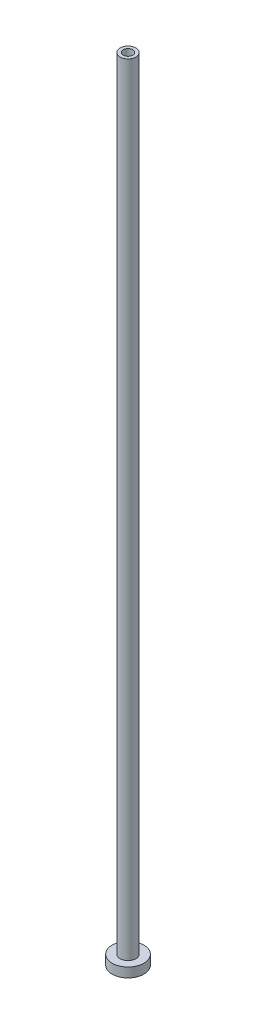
ISO-10303-21;
HEADER;
FILE_DESCRIPTION(('STEP AP214'),'2;1');
FILE_NAME('part.step','',(''),(''),'','','');
FILE_SCHEMA(('AUTOMOTIVE_DESIGN { 1 0 10303 214 1 1 1 1 }'));
ENDSEC;
DATA;
#1=APPLICATION_CONTEXT('core data for automotive mechanical design processes');
#2=APPLICATION_PROTOCOL_DEFINITION('international standard','automotive_design',2000,#1);
#3=PRODUCT_CONTEXT('',#1,'mechanical');
#4=PRODUCT('Part','Part','',(#3));
#5=PRODUCT_RELATED_PRODUCT_CATEGORY('part','',(#4));
#6=PRODUCT_DEFINITION_FORMATION('','',#4);
#7=PRODUCT_DEFINITION_CONTEXT('part definition',#1,'design');
#8=PRODUCT_DEFINITION('design','',#6,#7);
#9=PRODUCT_DEFINITION_SHAPE('','',#8);
#10=(LENGTH_UNIT() NAMED_UNIT(*) SI_UNIT(.MILLI.,.METRE.));
#11=(NAMED_UNIT(*) PLANE_ANGLE_UNIT() SI_UNIT($,.RADIAN.));
#12=(NAMED_UNIT(*) SI_UNIT($,.STERADIAN.) SOLID_ANGLE_UNIT());
#13=UNCERTAINTY_MEASURE_WITH_UNIT(LENGTH_MEASURE(1.E-05),#10,'distance_accuracy_value','');
#14=(GEOMETRIC_REPRESENTATION_CONTEXT(3) GLOBAL_UNCERTAINTY_ASSIGNED_CONTEXT((#13)) GLOBAL_UNIT_ASSIGNED_CONTEXT((#10,
#11,#12)) REPRESENTATION_CONTEXT('',''));
#15=CARTESIAN_POINT('',(0.,0.,0.));
#16=DIRECTION('',(0.,0.,1.));
#17=DIRECTION('',(1.,0.,0.));
#18=AXIS2_PLACEMENT_3D('',#15,#16,#17);
#19=CARTESIAN_POINT('',(0.,0.,0.));
#20=DIRECTION('',(0.,-1.,0.));
#21=DIRECTION('',(0.,0.,-1.));
#22=AXIS2_PLACEMENT_3D('',#19,#20,#21);
#23=CYLINDRICAL_SURFACE('',#22,5.);
#24=CARTESIAN_POINT('',(0.,-3.,0.));
#25=DIRECTION('',(0.,-1.,0.));
#26=DIRECTION('',(0.,0.,-1.));
#27=AXIS2_PLACEMENT_3D('',#24,#25,#26);
#28=CIRCLE('',#27,5.);
#29=CARTESIAN_POINT('',(0.,-3.,-5.));
#30=VERTEX_POINT('',#29);
#31=EDGE_CURVE('E41',#30,#30,#28,.T.);
#32=ORIENTED_EDGE('',*,*,#31,.F.);
#33=EDGE_LOOP('',(#32));
#34=FACE_BOUND('',#33,.T.);
#35=CARTESIAN_POINT('',(0.,0.,0.));
#36=DIRECTION('',(0.,-1.,0.));
#37=DIRECTION('',(0.,0.,-1.));
#38=AXIS2_PLACEMENT_3D('',#35,#36,#37);
#39=CIRCLE('',#38,5.);
#40=CARTESIAN_POINT('',(0.,0.,-5.));
#41=VERTEX_POINT('',#40);
#42=EDGE_CURVE('E8',#41,#41,#39,.T.);
#43=ORIENTED_EDGE('',*,*,#42,.T.);
#44=EDGE_LOOP('',(#43));
#45=FACE_BOUND('',#44,.T.);
#46=ADVANCED_FACE('F13',(#34,#45),#23,.T.);
#47=CARTESIAN_POINT('',(-5.,0.,0.));
#48=DIRECTION('',(0.,-1.,0.));
#49=DIRECTION('',(0.,0.,-1.));
#50=AXIS2_PLACEMENT_3D('',#47,#48,#49);
#51=PLANE('',#50);
#52=ORIENTED_EDGE('',*,*,#42,.F.);
#53=EDGE_LOOP('',(#52));
#54=FACE_BOUND('',#53,.T.);
#55=CARTESIAN_POINT('',(0.,0.,0.));
#56=DIRECTION('',(0.,-1.,0.));
#57=DIRECTION('',(0.,0.,-1.));
#58=AXIS2_PLACEMENT_3D('',#55,#56,#57);
#59=CIRCLE('',#58,2.5);
#60=CARTESIAN_POINT('',(0.,0.,-2.5));
#61=VERTEX_POINT('',#60);
#62=EDGE_CURVE('E19',#61,#61,#59,.T.);
#63=ORIENTED_EDGE('',*,*,#62,.T.);
#64=EDGE_LOOP('',(#63));
#65=FACE_BOUND('',#64,.T.);
#66=ADVANCED_FACE('F48',(#54,#65),#51,.F.);
#67=CARTESIAN_POINT('',(0.,0.,0.));
#68=DIRECTION('',(0.,-1.,0.));
#69=DIRECTION('',(0.,0.,-1.));
#70=AXIS2_PLACEMENT_3D('',#67,#68,#69);
#71=CYLINDRICAL_SURFACE('',#70,2.5);
#72=ORIENTED_EDGE('',*,*,#62,.F.);
#73=EDGE_LOOP('',(#72));
#74=FACE_BOUND('',#73,.T.);
#75=CARTESIAN_POINT('',(0.,247.,0.));
#76=DIRECTION('',(0.,-1.,0.));
#77=DIRECTION('',(0.,0.,-1.));
#78=AXIS2_PLACEMENT_3D('',#75,#76,#77);
#79=CIRCLE('',#78,2.5);
#80=CARTESIAN_POINT('',(0.,247.,-2.5));
#81=VERTEX_POINT('',#80);
#82=EDGE_CURVE('E23',#81,#81,#79,.T.);
#83=ORIENTED_EDGE('',*,*,#82,.T.);
#84=EDGE_LOOP('',(#83));
#85=FACE_BOUND('',#84,.T.);
#86=ADVANCED_FACE('F54',(#74,#85),#71,.T.);
#87=CARTESIAN_POINT('',(-2.5,247.,0.));
#88=DIRECTION('',(0.,-1.,0.));
#89=DIRECTION('',(0.,0.,-1.));
#90=AXIS2_PLACEMENT_3D('',#87,#88,#89);
#91=PLANE('',#90);
#92=ORIENTED_EDGE('',*,*,#82,.F.);
#93=EDGE_LOOP('',(#92));
#94=FACE_BOUND('',#93,.T.);
#95=CARTESIAN_POINT('',(0.,247.,0.));
#96=DIRECTION('',(0.,-1.,0.));
#97=DIRECTION('',(0.,0.,-1.));
#98=AXIS2_PLACEMENT_3D('',#95,#96,#97);
#99=CIRCLE('',#98,1.5);
#100=CARTESIAN_POINT('',(0.,247.,-1.5));
#101=VERTEX_POINT('',#100);
#102=EDGE_CURVE('E27',#101,#101,#99,.T.);
#103=ORIENTED_EDGE('',*,*,#102,.T.);
#104=EDGE_LOOP('',(#103));
#105=FACE_BOUND('',#104,.T.);
#106=ADVANCED_FACE('F60',(#94,#105),#91,.F.);
#107=CARTESIAN_POINT('',(0.,0.,0.));
#108=DIRECTION('',(0.,-1.,0.));
#109=DIRECTION('',(0.,0.,-1.));
#110=AXIS2_PLACEMENT_3D('',#107,#108,#109);
#111=CYLINDRICAL_SURFACE('',#110,1.5);
#112=ORIENTED_EDGE('',*,*,#102,.F.);
#113=EDGE_LOOP('',(#112));
#114=FACE_BOUND('',#113,.T.);
#115=CARTESIAN_POINT('',(0.,202.,0.));
#116=DIRECTION('',(0.,-1.,0.));
#117=DIRECTION('',(0.,0.,-1.));
#118=AXIS2_PLACEMENT_3D('',#115,#116,#117);
#119=CIRCLE('',#118,1.5);
#120=CARTESIAN_POINT('',(0.,202.,-1.5));
#121=VERTEX_POINT('',#120);
#122=EDGE_CURVE('E32',#121,#121,#119,.T.);
#123=ORIENTED_EDGE('',*,*,#122,.T.);
#124=EDGE_LOOP('',(#123));
#125=FACE_BOUND('',#124,.T.);
#126=ADVANCED_FACE('F66',(#114,#125),#111,.F.);
#127=CARTESIAN_POINT('',(0.,201.85,0.));
#128=DIRECTION('',(0.,-1.,0.));
#129=DIRECTION('',(0.,0.,-1.));
#130=AXIS2_PLACEMENT_3D('',#127,#128,#129);
#131=CONICAL_SURFACE('',#130,1.65,0.785398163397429);
#132=ORIENTED_EDGE('',*,*,#122,.F.);
#133=EDGE_LOOP('',(#132));
#134=FACE_BOUND('',#133,.T.);
#135=CARTESIAN_POINT('',(0.,201.85,0.));
#136=DIRECTION('',(0.,-1.,0.));
#137=DIRECTION('',(0.,0.,-1.));
#138=AXIS2_PLACEMENT_3D('',#135,#136,#137);
#139=CIRCLE('',#138,1.65);
#140=CARTESIAN_POINT('',(0.,201.85,-1.65));
#141=VERTEX_POINT('',#140);
#142=EDGE_CURVE('E35',#141,#141,#139,.T.);
#143=ORIENTED_EDGE('',*,*,#142,.T.);
#144=EDGE_LOOP('',(#143));
#145=FACE_BOUND('',#144,.T.);
#146=ADVANCED_FACE('F70',(#134,#145),#131,.F.);
#147=CARTESIAN_POINT('',(0.,0.,0.));
#148=DIRECTION('',(0.,-1.,0.));
#149=DIRECTION('',(0.,0.,-1.));
#150=AXIS2_PLACEMENT_3D('',#147,#148,#149);
#151=CYLINDRICAL_SURFACE('',#150,1.65);
#152=ORIENTED_EDGE('',*,*,#142,.F.);
#153=EDGE_LOOP('',(#152));
#154=FACE_BOUND('',#153,.T.);
#155=CARTESIAN_POINT('',(0.,-3.,0.));
#156=DIRECTION('',(0.,-1.,0.));
#157=DIRECTION('',(0.,0.,-1.));
#158=AXIS2_PLACEMENT_3D('',#155,#156,#157);
#159=CIRCLE('',#158,1.65);
#160=CARTESIAN_POINT('',(0.,-3.,-1.65));
#161=VERTEX_POINT('',#160);
#162=EDGE_CURVE('E38',#161,#161,#159,.T.);
#163=ORIENTED_EDGE('',*,*,#162,.T.);
#164=EDGE_LOOP('',(#163));
#165=FACE_BOUND('',#164,.T.);
#166=ADVANCED_FACE('F74',(#154,#165),#151,.F.);
#167=CARTESIAN_POINT('',(-1.65,-3.,0.));
#168=DIRECTION('',(0.,1.,0.));
#169=DIRECTION('',(0.,0.,1.));
#170=AXIS2_PLACEMENT_3D('',#167,#168,#169);
#171=PLANE('',#170);
#172=ORIENTED_EDGE('',*,*,#162,.F.);
#173=EDGE_LOOP('',(#172));
#174=FACE_BOUND('',#173,.T.);
#175=ORIENTED_EDGE('',*,*,#31,.T.);
#176=EDGE_LOOP('',(#175));
#177=FACE_BOUND('',#176,.T.);
#178=ADVANCED_FACE('F45',(#174,#177),#171,.F.);
#179=CLOSED_SHELL('',(#46,#66,#86,#106,#126,#146,#166,#178));
#180=MANIFOLD_SOLID_BREP('B1',#179);
#181=ADVANCED_BREP_SHAPE_REPRESENTATION('',(#18,#180),#14);
#182=SHAPE_DEFINITION_REPRESENTATION(#9,#181);
ENDSEC;
END-ISO-10303-21;
